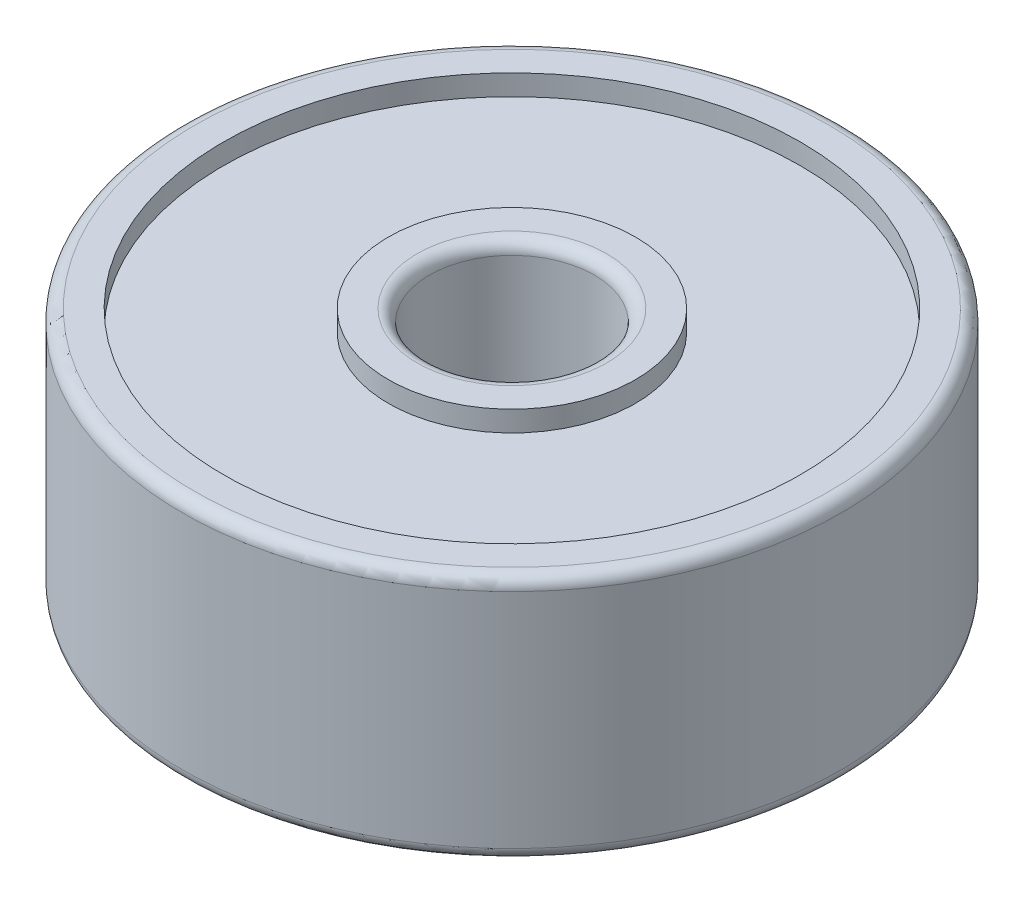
ISO-10303-21;
HEADER;
FILE_DESCRIPTION(('STEP AP214'),'2;1');
FILE_NAME('part.step','',(''),(''),'','','');
FILE_SCHEMA(('AUTOMOTIVE_DESIGN { 1 0 10303 214 1 1 1 1 }'));
ENDSEC;
DATA;
#1=APPLICATION_CONTEXT('core data for automotive mechanical design processes');
#2=APPLICATION_PROTOCOL_DEFINITION('international standard','automotive_design',2000,#1);
#3=PRODUCT_CONTEXT('',#1,'mechanical');
#4=PRODUCT('Part','Part','',(#3));
#5=PRODUCT_RELATED_PRODUCT_CATEGORY('part','',(#4));
#6=PRODUCT_DEFINITION_FORMATION('','',#4);
#7=PRODUCT_DEFINITION_CONTEXT('part definition',#1,'design');
#8=PRODUCT_DEFINITION('design','',#6,#7);
#9=PRODUCT_DEFINITION_SHAPE('','',#8);
#10=(LENGTH_UNIT() NAMED_UNIT(*) SI_UNIT(.MILLI.,.METRE.));
#11=(NAMED_UNIT(*) PLANE_ANGLE_UNIT() SI_UNIT($,.RADIAN.));
#12=(NAMED_UNIT(*) SI_UNIT($,.STERADIAN.) SOLID_ANGLE_UNIT());
#13=UNCERTAINTY_MEASURE_WITH_UNIT(LENGTH_MEASURE(1.E-05),#10,'distance_accuracy_value','');
#14=(GEOMETRIC_REPRESENTATION_CONTEXT(3) GLOBAL_UNCERTAINTY_ASSIGNED_CONTEXT((#13)) GLOBAL_UNIT_ASSIGNED_CONTEXT((#10,
#11,#12)) REPRESENTATION_CONTEXT('',''));
#15=CARTESIAN_POINT('',(0.,0.,0.));
#16=DIRECTION('',(0.,0.,1.));
#17=DIRECTION('',(1.,0.,0.));
#18=AXIS2_PLACEMENT_3D('',#15,#16,#17);
#19=CARTESIAN_POINT('',(0.,-2.7,0.));
#20=DIRECTION('',(0.,-1.,0.));
#21=DIRECTION('',(0.,0.,-1.));
#22=AXIS2_PLACEMENT_3D('',#19,#20,#21);
#23=TOROIDAL_SURFACE('',#22,2.3,0.3);
#24=CARTESIAN_POINT('',(0.,-2.7,0.));
#25=DIRECTION('',(0.,-1.,0.));
#26=DIRECTION('',(0.,0.,-1.));
#27=AXIS2_PLACEMENT_3D('',#24,#25,#26);
#28=CIRCLE('',#27,2.);
#29=CARTESIAN_POINT('',(0.,-2.7,-2.));
#30=VERTEX_POINT('',#29);
#31=EDGE_CURVE('E10',#30,#30,#28,.T.);
#32=ORIENTED_EDGE('',*,*,#31,.F.);
#33=EDGE_LOOP('',(#32));
#34=FACE_BOUND('',#33,.T.);
#35=CARTESIAN_POINT('',(0.,-3.,0.));
#36=DIRECTION('',(0.,-1.,0.));
#37=DIRECTION('',(0.,0.,-1.));
#38=AXIS2_PLACEMENT_3D('',#35,#36,#37);
#39=CIRCLE('',#38,2.3);
#40=CARTESIAN_POINT('',(0.,-3.,-2.3));
#41=VERTEX_POINT('',#40);
#42=EDGE_CURVE('E82',#41,#41,#39,.T.);
#43=ORIENTED_EDGE('',*,*,#42,.T.);
#44=EDGE_LOOP('',(#43));
#45=FACE_BOUND('',#44,.T.);
#46=ADVANCED_FACE('F30',(#34,#45),#23,.T.);
#47=CARTESIAN_POINT('',(0.,0.,0.));
#48=DIRECTION('',(0.,-1.,0.));
#49=DIRECTION('',(0.,0.,-1.));
#50=AXIS2_PLACEMENT_3D('',#47,#48,#49);
#51=CYLINDRICAL_SURFACE('',#50,2.);
#52=CARTESIAN_POINT('',(0.,2.7,0.));
#53=DIRECTION('',(0.,-1.,0.));
#54=DIRECTION('',(0.,0.,-1.));
#55=AXIS2_PLACEMENT_3D('',#52,#53,#54);
#56=CIRCLE('',#55,2.);
#57=CARTESIAN_POINT('',(0.,2.7,-2.));
#58=VERTEX_POINT('',#57);
#59=EDGE_CURVE('E36',#58,#58,#56,.T.);
#60=ORIENTED_EDGE('',*,*,#59,.F.);
#61=EDGE_LOOP('',(#60));
#62=FACE_BOUND('',#61,.T.);
#63=ORIENTED_EDGE('',*,*,#31,.T.);
#64=EDGE_LOOP('',(#63));
#65=FACE_BOUND('',#64,.T.);
#66=ADVANCED_FACE('F167',(#62,#65),#51,.F.);
#67=CARTESIAN_POINT('',(0.,2.7,0.));
#68=DIRECTION('',(0.,-1.,0.));
#69=DIRECTION('',(0.,0.,-1.));
#70=AXIS2_PLACEMENT_3D('',#67,#68,#69);
#71=TOROIDAL_SURFACE('',#70,2.3,0.3);
#72=CARTESIAN_POINT('',(0.,3.,0.));
#73=DIRECTION('',(0.,-1.,0.));
#74=DIRECTION('',(0.,0.,-1.));
#75=AXIS2_PLACEMENT_3D('',#72,#73,#74);
#76=CIRCLE('',#75,2.3);
#77=CARTESIAN_POINT('',(0.,3.,-2.3));
#78=VERTEX_POINT('',#77);
#79=EDGE_CURVE('E40',#78,#78,#76,.T.);
#80=ORIENTED_EDGE('',*,*,#79,.F.);
#81=EDGE_LOOP('',(#80));
#82=FACE_BOUND('',#81,.T.);
#83=ORIENTED_EDGE('',*,*,#59,.T.);
#84=EDGE_LOOP('',(#83));
#85=FACE_BOUND('',#84,.T.);
#86=ADVANCED_FACE('F162',(#82,#85),#71,.T.);
#87=CARTESIAN_POINT('',(-2.3,3.,0.));
#88=DIRECTION('',(0.,-1.,0.));
#89=DIRECTION('',(0.,0.,-1.));
#90=AXIS2_PLACEMENT_3D('',#87,#88,#89);
#91=PLANE('',#90);
#92=CARTESIAN_POINT('',(0.,3.,0.));
#93=DIRECTION('',(0.,-1.,0.));
#94=DIRECTION('',(0.,0.,-1.));
#95=AXIS2_PLACEMENT_3D('',#92,#93,#94);
#96=CIRCLE('',#95,3.);
#97=CARTESIAN_POINT('',(0.,3.,-3.));
#98=VERTEX_POINT('',#97);
#99=EDGE_CURVE('E44',#98,#98,#96,.T.);
#100=ORIENTED_EDGE('',*,*,#99,.F.);
#101=EDGE_LOOP('',(#100));
#102=FACE_BOUND('',#101,.T.);
#103=ORIENTED_EDGE('',*,*,#79,.T.);
#104=EDGE_LOOP('',(#103));
#105=FACE_BOUND('',#104,.T.);
#106=ADVANCED_FACE('F156',(#102,#105),#91,.F.);
#107=CARTESIAN_POINT('',(0.,0.,0.));
#108=DIRECTION('',(0.,-1.,0.));
#109=DIRECTION('',(0.,0.,-1.));
#110=AXIS2_PLACEMENT_3D('',#107,#108,#109);
#111=CYLINDRICAL_SURFACE('',#110,3.);
#112=CARTESIAN_POINT('',(0.,2.5,0.));
#113=DIRECTION('',(0.,-1.,0.));
#114=DIRECTION('',(0.,0.,-1.));
#115=AXIS2_PLACEMENT_3D('',#112,#113,#114);
#116=CIRCLE('',#115,3.);
#117=CARTESIAN_POINT('',(0.,2.5,-3.));
#118=VERTEX_POINT('',#117);
#119=EDGE_CURVE('E49',#118,#118,#116,.T.);
#120=ORIENTED_EDGE('',*,*,#119,.F.);
#121=EDGE_LOOP('',(#120));
#122=FACE_BOUND('',#121,.T.);
#123=ORIENTED_EDGE('',*,*,#99,.T.);
#124=EDGE_LOOP('',(#123));
#125=FACE_BOUND('',#124,.T.);
#126=ADVANCED_FACE('F150',(#122,#125),#111,.T.);
#127=CARTESIAN_POINT('',(-3.,2.5,0.));
#128=DIRECTION('',(0.,-1.,0.));
#129=DIRECTION('',(0.,0.,-1.));
#130=AXIS2_PLACEMENT_3D('',#127,#128,#129);
#131=PLANE('',#130);
#132=CARTESIAN_POINT('',(0.,2.5,0.));
#133=DIRECTION('',(0.,-1.,0.));
#134=DIRECTION('',(0.,0.,-1.));
#135=AXIS2_PLACEMENT_3D('',#132,#133,#134);
#136=CIRCLE('',#135,7.);
#137=CARTESIAN_POINT('',(0.,2.5,-7.));
#138=VERTEX_POINT('',#137);
#139=EDGE_CURVE('E52',#138,#138,#136,.T.);
#140=ORIENTED_EDGE('',*,*,#139,.F.);
#141=EDGE_LOOP('',(#140));
#142=FACE_BOUND('',#141,.T.);
#143=ORIENTED_EDGE('',*,*,#119,.T.);
#144=EDGE_LOOP('',(#143));
#145=FACE_BOUND('',#144,.T.);
#146=ADVANCED_FACE('F144',(#142,#145),#131,.F.);
#147=CARTESIAN_POINT('',(0.,0.,0.));
#148=DIRECTION('',(0.,-1.,0.));
#149=DIRECTION('',(0.,0.,-1.));
#150=AXIS2_PLACEMENT_3D('',#147,#148,#149);
#151=CYLINDRICAL_SURFACE('',#150,7.);
#152=CARTESIAN_POINT('',(0.,3.,0.));
#153=DIRECTION('',(0.,-1.,0.));
#154=DIRECTION('',(0.,0.,-1.));
#155=AXIS2_PLACEMENT_3D('',#152,#153,#154);
#156=CIRCLE('',#155,7.);
#157=CARTESIAN_POINT('',(0.,3.,-7.));
#158=VERTEX_POINT('',#157);
#159=EDGE_CURVE('E55',#158,#158,#156,.T.);
#160=ORIENTED_EDGE('',*,*,#159,.F.);
#161=EDGE_LOOP('',(#160));
#162=FACE_BOUND('',#161,.T.);
#163=ORIENTED_EDGE('',*,*,#139,.T.);
#164=EDGE_LOOP('',(#163));
#165=FACE_BOUND('',#164,.T.);
#166=ADVANCED_FACE('F138',(#162,#165),#151,.F.);
#167=CARTESIAN_POINT('',(-7.,3.,0.));
#168=DIRECTION('',(0.,-1.,0.));
#169=DIRECTION('',(0.,0.,-1.));
#170=AXIS2_PLACEMENT_3D('',#167,#168,#169);
#171=PLANE('',#170);
#172=CARTESIAN_POINT('',(0.,3.,0.));
#173=DIRECTION('',(0.,-1.,0.));
#174=DIRECTION('',(0.,0.,-1.));
#175=AXIS2_PLACEMENT_3D('',#172,#173,#174);
#176=CIRCLE('',#175,7.7);
#177=CARTESIAN_POINT('',(0.,3.,-7.7));
#178=VERTEX_POINT('',#177);
#179=EDGE_CURVE('E58',#178,#178,#176,.T.);
#180=ORIENTED_EDGE('',*,*,#179,.F.);
#181=EDGE_LOOP('',(#180));
#182=FACE_BOUND('',#181,.T.);
#183=ORIENTED_EDGE('',*,*,#159,.T.);
#184=EDGE_LOOP('',(#183));
#185=FACE_BOUND('',#184,.T.);
#186=ADVANCED_FACE('F132',(#182,#185),#171,.F.);
#187=CARTESIAN_POINT('',(0.,2.7,0.));
#188=DIRECTION('',(0.,-1.,0.));
#189=DIRECTION('',(0.,0.,-1.));
#190=AXIS2_PLACEMENT_3D('',#187,#188,#189);
#191=TOROIDAL_SURFACE('',#190,7.7,0.299999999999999);
#192=CARTESIAN_POINT('',(0.,2.7,0.));
#193=DIRECTION('',(0.,-1.,0.));
#194=DIRECTION('',(0.,0.,-1.));
#195=AXIS2_PLACEMENT_3D('',#192,#193,#194);
#196=CIRCLE('',#195,8.);
#197=CARTESIAN_POINT('',(0.,2.7,-8.));
#198=VERTEX_POINT('',#197);
#199=EDGE_CURVE('E61',#198,#198,#196,.T.);
#200=ORIENTED_EDGE('',*,*,#199,.F.);
#201=EDGE_LOOP('',(#200));
#202=FACE_BOUND('',#201,.T.);
#203=ORIENTED_EDGE('',*,*,#179,.T.);
#204=EDGE_LOOP('',(#203));
#205=FACE_BOUND('',#204,.T.);
#206=ADVANCED_FACE('F126',(#202,#205),#191,.T.);
#207=CARTESIAN_POINT('',(0.,0.,0.));
#208=DIRECTION('',(0.,-1.,0.));
#209=DIRECTION('',(0.,0.,-1.));
#210=AXIS2_PLACEMENT_3D('',#207,#208,#209);
#211=CYLINDRICAL_SURFACE('',#210,8.);
#212=CARTESIAN_POINT('',(0.,-2.7,0.));
#213=DIRECTION('',(0.,-1.,0.));
#214=DIRECTION('',(0.,0.,-1.));
#215=AXIS2_PLACEMENT_3D('',#212,#213,#214);
#216=CIRCLE('',#215,8.);
#217=CARTESIAN_POINT('',(0.,-2.7,-8.));
#218=VERTEX_POINT('',#217);
#219=EDGE_CURVE('E64',#218,#218,#216,.T.);
#220=ORIENTED_EDGE('',*,*,#219,.F.);
#221=EDGE_LOOP('',(#220));
#222=FACE_BOUND('',#221,.T.);
#223=ORIENTED_EDGE('',*,*,#199,.T.);
#224=EDGE_LOOP('',(#223));
#225=FACE_BOUND('',#224,.T.);
#226=ADVANCED_FACE('F120',(#222,#225),#211,.T.);
#227=CARTESIAN_POINT('',(0.,-2.7,0.));
#228=DIRECTION('',(0.,-1.,0.));
#229=DIRECTION('',(0.,0.,-1.));
#230=AXIS2_PLACEMENT_3D('',#227,#228,#229);
#231=TOROIDAL_SURFACE('',#230,7.7,0.3);
#232=CARTESIAN_POINT('',(0.,-3.,0.));
#233=DIRECTION('',(0.,-1.,0.));
#234=DIRECTION('',(0.,0.,-1.));
#235=AXIS2_PLACEMENT_3D('',#232,#233,#234);
#236=CIRCLE('',#235,7.7);
#237=CARTESIAN_POINT('',(0.,-3.,-7.7));
#238=VERTEX_POINT('',#237);
#239=EDGE_CURVE('E67',#238,#238,#236,.T.);
#240=ORIENTED_EDGE('',*,*,#239,.F.);
#241=EDGE_LOOP('',(#240));
#242=FACE_BOUND('',#241,.T.);
#243=ORIENTED_EDGE('',*,*,#219,.T.);
#244=EDGE_LOOP('',(#243));
#245=FACE_BOUND('',#244,.T.);
#246=ADVANCED_FACE('F114',(#242,#245),#231,.T.);
#247=CARTESIAN_POINT('',(-7.,-3.,0.));
#248=DIRECTION('',(0.,1.,0.));
#249=DIRECTION('',(0.,0.,1.));
#250=AXIS2_PLACEMENT_3D('',#247,#248,#249);
#251=PLANE('',#250);
#252=CARTESIAN_POINT('',(0.,-3.,0.));
#253=DIRECTION('',(0.,-1.,0.));
#254=DIRECTION('',(0.,0.,-1.));
#255=AXIS2_PLACEMENT_3D('',#252,#253,#254);
#256=CIRCLE('',#255,7.);
#257=CARTESIAN_POINT('',(0.,-3.,-7.));
#258=VERTEX_POINT('',#257);
#259=EDGE_CURVE('E70',#258,#258,#256,.T.);
#260=ORIENTED_EDGE('',*,*,#259,.F.);
#261=EDGE_LOOP('',(#260));
#262=FACE_BOUND('',#261,.T.);
#263=ORIENTED_EDGE('',*,*,#239,.T.);
#264=EDGE_LOOP('',(#263));
#265=FACE_BOUND('',#264,.T.);
#266=ADVANCED_FACE('F108',(#262,#265),#251,.F.);
#267=CARTESIAN_POINT('',(0.,0.,0.));
#268=DIRECTION('',(0.,-1.,0.));
#269=DIRECTION('',(0.,0.,-1.));
#270=AXIS2_PLACEMENT_3D('',#267,#268,#269);
#271=CYLINDRICAL_SURFACE('',#270,7.);
#272=CARTESIAN_POINT('',(0.,-2.5,0.));
#273=DIRECTION('',(0.,-1.,0.));
#274=DIRECTION('',(0.,0.,-1.));
#275=AXIS2_PLACEMENT_3D('',#272,#273,#274);
#276=CIRCLE('',#275,7.);
#277=CARTESIAN_POINT('',(0.,-2.5,-7.));
#278=VERTEX_POINT('',#277);
#279=EDGE_CURVE('E73',#278,#278,#276,.T.);
#280=ORIENTED_EDGE('',*,*,#279,.F.);
#281=EDGE_LOOP('',(#280));
#282=FACE_BOUND('',#281,.T.);
#283=ORIENTED_EDGE('',*,*,#259,.T.);
#284=EDGE_LOOP('',(#283));
#285=FACE_BOUND('',#284,.T.);
#286=ADVANCED_FACE('F102',(#282,#285),#271,.F.);
#287=CARTESIAN_POINT('',(-3.,-2.5,0.));
#288=DIRECTION('',(0.,1.,0.));
#289=DIRECTION('',(0.,0.,1.));
#290=AXIS2_PLACEMENT_3D('',#287,#288,#289);
#291=PLANE('',#290);
#292=CARTESIAN_POINT('',(0.,-2.5,0.));
#293=DIRECTION('',(0.,-1.,0.));
#294=DIRECTION('',(0.,0.,-1.));
#295=AXIS2_PLACEMENT_3D('',#292,#293,#294);
#296=CIRCLE('',#295,3.);
#297=CARTESIAN_POINT('',(0.,-2.5,-3.));
#298=VERTEX_POINT('',#297);
#299=EDGE_CURVE('E76',#298,#298,#296,.T.);
#300=ORIENTED_EDGE('',*,*,#299,.F.);
#301=EDGE_LOOP('',(#300));
#302=FACE_BOUND('',#301,.T.);
#303=ORIENTED_EDGE('',*,*,#279,.T.);
#304=EDGE_LOOP('',(#303));
#305=FACE_BOUND('',#304,.T.);
#306=ADVANCED_FACE('F96',(#302,#305),#291,.F.);
#307=CARTESIAN_POINT('',(0.,0.,0.));
#308=DIRECTION('',(0.,-1.,0.));
#309=DIRECTION('',(0.,0.,-1.));
#310=AXIS2_PLACEMENT_3D('',#307,#308,#309);
#311=CYLINDRICAL_SURFACE('',#310,3.);
#312=CARTESIAN_POINT('',(0.,-3.,0.));
#313=DIRECTION('',(0.,-1.,0.));
#314=DIRECTION('',(0.,0.,-1.));
#315=AXIS2_PLACEMENT_3D('',#312,#313,#314);
#316=CIRCLE('',#315,3.);
#317=CARTESIAN_POINT('',(0.,-3.,-3.));
#318=VERTEX_POINT('',#317);
#319=EDGE_CURVE('E79',#318,#318,#316,.T.);
#320=ORIENTED_EDGE('',*,*,#319,.F.);
#321=EDGE_LOOP('',(#320));
#322=FACE_BOUND('',#321,.T.);
#323=ORIENTED_EDGE('',*,*,#299,.T.);
#324=EDGE_LOOP('',(#323));
#325=FACE_BOUND('',#324,.T.);
#326=ADVANCED_FACE('F90',(#322,#325),#311,.T.);
#327=CARTESIAN_POINT('',(-2.3,-3.,0.));
#328=DIRECTION('',(0.,1.,0.));
#329=DIRECTION('',(0.,0.,1.));
#330=AXIS2_PLACEMENT_3D('',#327,#328,#329);
#331=PLANE('',#330);
#332=ORIENTED_EDGE('',*,*,#42,.F.);
#333=EDGE_LOOP('',(#332));
#334=FACE_BOUND('',#333,.T.);
#335=ORIENTED_EDGE('',*,*,#319,.T.);
#336=EDGE_LOOP('',(#335));
#337=FACE_BOUND('',#336,.T.);
#338=ADVANCED_FACE('F87',(#334,#337),#331,.F.);
#339=CLOSED_SHELL('',(#46,#66,#86,#106,#126,#146,#166,#186,#206,#226,#246,#266,#286,#306,#326,#338));
#340=MANIFOLD_SOLID_BREP('B2',#339);
#341=ADVANCED_BREP_SHAPE_REPRESENTATION('',(#18,#340),#14);
#342=SHAPE_DEFINITION_REPRESENTATION(#9,#341);
ENDSEC;
END-ISO-10303-21;
